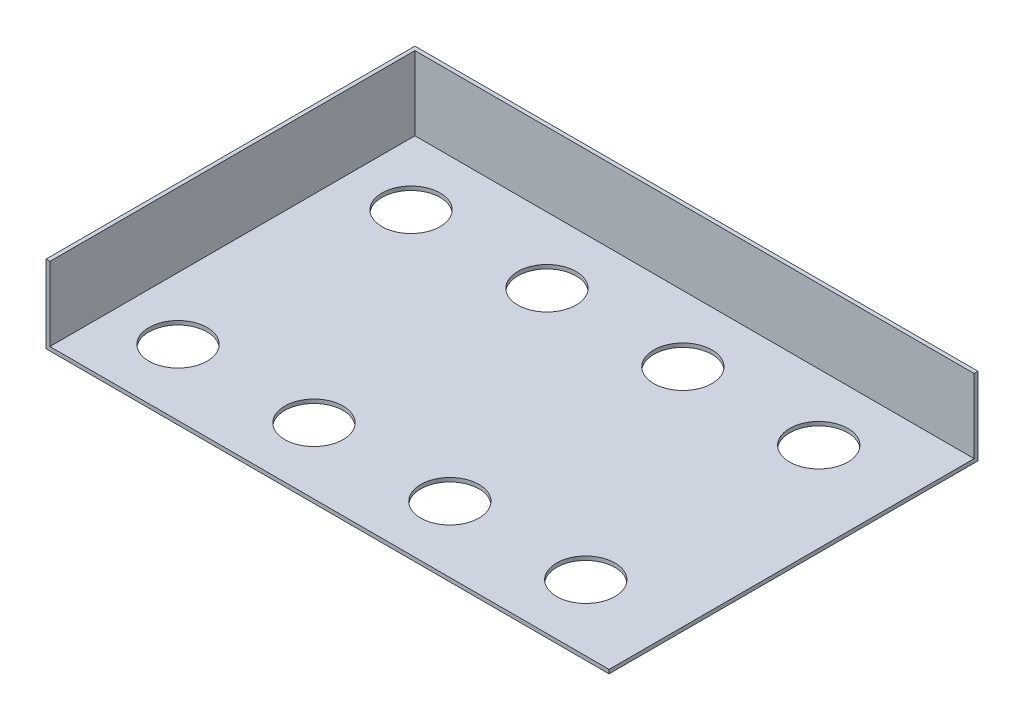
from build123d import *

# Parameters (mm, degrees)
SKETCH1_W            = 145
SKETCH1_H            = 95
EXTRUDE1_DEPTH       = 20
SHELL1_T             = -1
SKETCH2_R            = 7.5
CUT_EXTRUDE2_DEPTH   = 89.952234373
LPATTERN2_COUNT      = 4
LPATTERN2_PITCH      = 35
LPATTERN2_COUNT_DIR2 = 2
LPATTERN2_PITCH_DIR2 = 60


with BuildPart() as part:
    # Sketch1 → Extrude1 (new body)
    with BuildSketch(Plane(origin=(0, 0, 0), x_dir=(1, 0, 0), z_dir=(0, 1, 0))):
        Rectangle(SKETCH1_W, SKETCH1_H)
    extrude(amount=EXTRUDE1_DEPTH)

    # Shell1
    shell1_openings = [part.faces().sort_by_distance(p)[0] for p in [
        (0, 20, 0),
        (72.5, 10, 0),
        (0, 10, 47.5),
    ]]
    offset(amount=SHELL1_T, openings=shell1_openings, kind=Kind.INTERSECTION)

    # Sketch2 → Cut-Extrude2 (cut, through all)
    with BuildSketch(Plane(origin=(0, 20, 0), x_dir=(-1, 0, 0), z_dir=(0, 1, 0))):
        with Locations(Location((55.5, 30.5, 0), (0, 0, 90))):
            Circle(SKETCH2_R)
    cut_extrude2 = extrude(amount=-CUT_EXTRUDE2_DEPTH, mode=Mode.SUBTRACT)

    # LPattern2: Cut-Extrude2 4 × 2
    with Locations(*[(i * LPATTERN2_PITCH, 0, -j * LPATTERN2_PITCH_DIR2) for i in range(LPATTERN2_COUNT) for j in range(LPATTERN2_COUNT_DIR2) if (i, j) != (0, 0)]):
        add(cut_extrude2, mode=Mode.SUBTRACT)


solid = part.part
